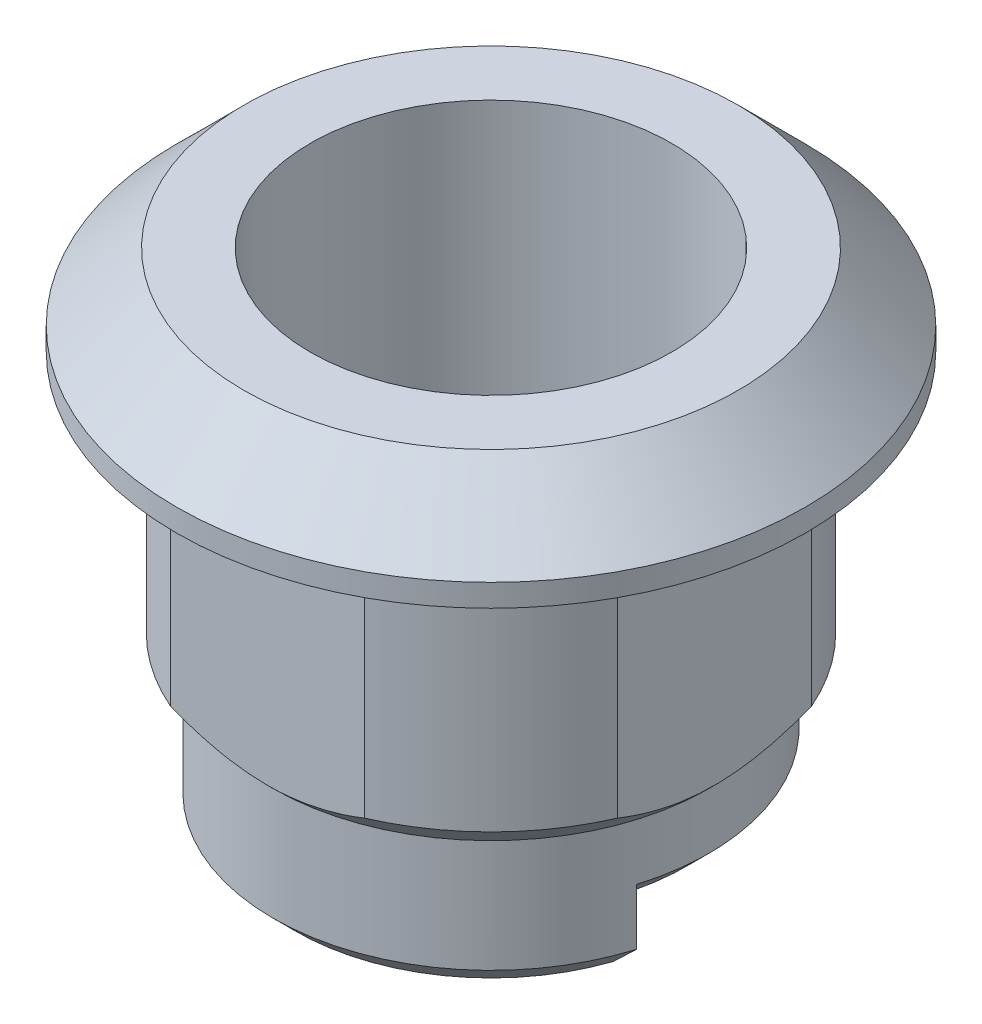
ISO-10303-21;
HEADER;
FILE_DESCRIPTION(('STEP AP214'),'2;1');
FILE_NAME('part.step','',(''),(''),'','','');
FILE_SCHEMA(('AUTOMOTIVE_DESIGN { 1 0 10303 214 1 1 1 1 }'));
ENDSEC;
DATA;
#1=APPLICATION_CONTEXT('core data for automotive mechanical design processes');
#2=APPLICATION_PROTOCOL_DEFINITION('international standard','automotive_design',2000,#1);
#3=PRODUCT_CONTEXT('',#1,'mechanical');
#4=PRODUCT('Part','Part','',(#3));
#5=PRODUCT_RELATED_PRODUCT_CATEGORY('part','',(#4));
#6=PRODUCT_DEFINITION_FORMATION('','',#4);
#7=PRODUCT_DEFINITION_CONTEXT('part definition',#1,'design');
#8=PRODUCT_DEFINITION('design','',#6,#7);
#9=PRODUCT_DEFINITION_SHAPE('','',#8);
#10=(LENGTH_UNIT() NAMED_UNIT(*) SI_UNIT(.MILLI.,.METRE.));
#11=(NAMED_UNIT(*) PLANE_ANGLE_UNIT() SI_UNIT($,.RADIAN.));
#12=(NAMED_UNIT(*) SI_UNIT($,.STERADIAN.) SOLID_ANGLE_UNIT());
#13=UNCERTAINTY_MEASURE_WITH_UNIT(LENGTH_MEASURE(1.E-05),#10,'distance_accuracy_value','');
#14=(GEOMETRIC_REPRESENTATION_CONTEXT(3) GLOBAL_UNCERTAINTY_ASSIGNED_CONTEXT((#13)) GLOBAL_UNIT_ASSIGNED_CONTEXT((#10,
#11,#12)) REPRESENTATION_CONTEXT('',''));
#15=CARTESIAN_POINT('',(0.,0.,0.));
#16=DIRECTION('',(0.,0.,1.));
#17=DIRECTION('',(1.,0.,0.));
#18=AXIS2_PLACEMENT_3D('',#15,#16,#17);
#19=CARTESIAN_POINT('',(0.,5.91279690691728,0.));
#20=DIRECTION('',(0.,1.,0.));
#21=DIRECTION('',(0.,0.,1.));
#22=AXIS2_PLACEMENT_3D('',#19,#20,#21);
#23=CYLINDRICAL_SURFACE('',#22,10.85);
#24=DIRECTION('',(0.,1.,0.));
#25=VECTOR('',#24,1.);
#26=CARTESIAN_POINT('',(-9.95,44.1244157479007,-4.32666153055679));
#27=LINE('',#26,#25);
#28=CARTESIAN_POINT('',(-9.95,0.,-4.32666153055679));
#29=VERTEX_POINT('',#28);
#30=CARTESIAN_POINT('',(-9.95,-10.85,-4.32666153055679));
#31=VERTEX_POINT('',#30);
#32=EDGE_CURVE('E119',#29,#31,#27,.F.);
#33=ORIENTED_EDGE('',*,*,#32,.F.);
#34=CARTESIAN_POINT('',(0.,0.,0.));
#35=DIRECTION('',(0.,1.,0.));
#36=DIRECTION('',(0.,0.,1.));
#37=AXIS2_PLACEMENT_3D('',#34,#35,#36);
#38=CIRCLE('',#37,10.85);
#39=CARTESIAN_POINT('',(-4.32666153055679,0.,-9.95));
#40=VERTEX_POINT('',#39);
#41=EDGE_CURVE('E297',#29,#40,#38,.F.);
#42=ORIENTED_EDGE('',*,*,#41,.T.);
#43=DIRECTION('',(0.,1.,0.));
#44=VECTOR('',#43,1.);
#45=CARTESIAN_POINT('',(-4.32666153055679,44.1244157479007,-9.95));
#46=LINE('',#45,#44);
#47=CARTESIAN_POINT('',(-4.32666153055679,-10.85,-9.95));
#48=VERTEX_POINT('',#47);
#49=EDGE_CURVE('E140',#48,#40,#46,.T.);
#50=ORIENTED_EDGE('',*,*,#49,.F.);
#51=CARTESIAN_POINT('',(0.,-10.85,0.));
#52=DIRECTION('',(0.,1.,0.));
#53=DIRECTION('',(0.,0.,1.));
#54=AXIS2_PLACEMENT_3D('',#51,#52,#53);
#55=CIRCLE('',#54,10.85);
#56=EDGE_CURVE('E134',#31,#48,#55,.F.);
#57=ORIENTED_EDGE('',*,*,#56,.F.);
#58=EDGE_LOOP('',(#33,#42,#50,#57));
#59=FACE_BOUND('',#58,.T.);
#60=ADVANCED_FACE('F16',(#59),#23,.T.);
#61=CARTESIAN_POINT('',(-9.95,44.1244157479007,-9.95));
#62=DIRECTION('',(0.,0.,-1.));
#63=DIRECTION('',(-1.,0.,0.));
#64=AXIS2_PLACEMENT_3D('',#61,#62,#63);
#65=PLANE('',#64);
#66=DIRECTION('',(0.,1.,0.));
#67=VECTOR('',#66,1.);
#68=CARTESIAN_POINT('',(4.32666153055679,5.91279690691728,-9.95));
#69=LINE('',#68,#67);
#70=CARTESIAN_POINT('',(4.32666153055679,-10.85,-9.95));
#71=VERTEX_POINT('',#70);
#72=CARTESIAN_POINT('',(4.32666153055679,0.,-9.95));
#73=VERTEX_POINT('',#72);
#74=EDGE_CURVE('E308',#71,#73,#69,.T.);
#75=ORIENTED_EDGE('',*,*,#74,.F.);
#76=CARTESIAN_POINT('',(-4.32666153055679,-10.85,-9.95));
#77=CARTESIAN_POINT('',(-4.15399995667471,-10.9188427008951,-9.95));
#78=CARTESIAN_POINT('',(-3.98016657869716,-10.9847033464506,-9.95));
#79=CARTESIAN_POINT('',(-3.63004510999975,-11.1097733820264,-9.95));
#80=CARTESIAN_POINT('',(-3.45375601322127,-11.1689799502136,-9.95));
#81=CARTESIAN_POINT('',(-2.92031040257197,-11.3357995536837,-9.95));
#82=CARTESIAN_POINT('',(-2.55949801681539,-11.4322367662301,-9.95));
#83=CARTESIAN_POINT('',(-2.0145703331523,-11.5496360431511,-9.95));
#84=CARTESIAN_POINT('',(-1.83329033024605,-11.5841131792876,-9.95));
#85=CARTESIAN_POINT('',(-1.46920939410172,-11.6437152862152,-9.95));
#86=CARTESIAN_POINT('',(-1.28640873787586,-11.6688419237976,-9.95));
#87=CARTESIAN_POINT('',(-0.919947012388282,-11.7092199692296,-9.95));
#88=CARTESIAN_POINT('',(-0.736287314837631,-11.7244837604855,-9.95));
#89=CARTESIAN_POINT('',(-0.368426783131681,-11.7448766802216,-9.95));
#90=CARTESIAN_POINT('',(-0.184225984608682,-11.7500064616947,-9.95));
#91=CARTESIAN_POINT('',(0.302858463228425,-11.7499893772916,-9.95));
#92=CARTESIAN_POINT('',(0.605784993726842,-11.73609767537,-9.95));
#93=CARTESIAN_POINT('',(1.2092236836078,-11.6813034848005,-9.95));
#94=CARTESIAN_POINT('',(1.50973490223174,-11.6403909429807,-9.95));
#95=CARTESIAN_POINT('',(2.10613484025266,-11.5337712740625,-9.95));
#96=CARTESIAN_POINT('',(2.40202540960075,-11.4680743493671,-9.95));
#97=CARTESIAN_POINT('',(2.98796571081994,-11.3148937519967,-9.95));
#98=CARTESIAN_POINT('',(3.27801714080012,-11.2274165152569,-9.95));
#99=CARTESIAN_POINT('',(3.69322141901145,-11.087376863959,-9.95));
#100=CARTESIAN_POINT('',(3.8209365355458,-11.0422286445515,-9.95));
#101=CARTESIAN_POINT('',(4.0748616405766,-10.9485763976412,-9.95));
#102=CARTESIAN_POINT('',(4.20107398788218,-10.9000787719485,-9.95));
#103=CARTESIAN_POINT('',(4.3266615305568,-10.85,-9.95));
#104=B_SPLINE_CURVE_WITH_KNOTS('',3,(#76,#77,#78,#79,#80,#81,#82,#83,#84,#85,#86,#87,#88,#89,
#90,#91,#92,#93,#94,#95,#96,#97,#98,#99,#100,#101,#102,#103),.UNSPECIFIED.,.F.,.F.,(4,2,2,2,2,2,
2,2,2,2,2,2,2,4),(0.,0.557565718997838,1.1153670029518,2.23394979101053,2.78734367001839,
3.34063885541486,3.89323798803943,4.44580151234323,5.3541887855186,6.26291421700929,
7.17126598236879,8.07934965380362,8.485692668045,8.89127944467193),.UNSPECIFIED.);
#105=EDGE_CURVE('E141',#48,#71,#104,.T.);
#106=ORIENTED_EDGE('',*,*,#105,.F.);
#107=ORIENTED_EDGE('',*,*,#49,.T.);
#108=DIRECTION('',(1.,0.,0.));
#109=VECTOR('',#108,1.);
#110=CARTESIAN_POINT('',(10.85,0.,-9.95));
#111=LINE('',#110,#109);
#112=EDGE_CURVE('E294',#40,#73,#111,.T.);
#113=ORIENTED_EDGE('',*,*,#112,.T.);
#114=EDGE_LOOP('',(#75,#106,#107,#113));
#115=FACE_BOUND('',#114,.T.);
#116=ADVANCED_FACE('F341',(#115),#65,.T.);
#117=CARTESIAN_POINT('',(0.,5.91279690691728,0.));
#118=DIRECTION('',(0.,1.,0.));
#119=DIRECTION('',(0.,0.,1.));
#120=AXIS2_PLACEMENT_3D('',#117,#118,#119);
#121=CYLINDRICAL_SURFACE('',#120,10.85);
#122=DIRECTION('',(0.,1.,0.));
#123=VECTOR('',#122,1.);
#124=CARTESIAN_POINT('',(9.95,44.1244157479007,-4.32666153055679));
#125=LINE('',#124,#123);
#126=CARTESIAN_POINT('',(9.95,-10.85,-4.32666153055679));
#127=VERTEX_POINT('',#126);
#128=CARTESIAN_POINT('',(9.95,0.,-4.32666153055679));
#129=VERTEX_POINT('',#128);
#130=EDGE_CURVE('E306',#127,#129,#125,.T.);
#131=ORIENTED_EDGE('',*,*,#130,.F.);
#132=CARTESIAN_POINT('',(0.,-10.85,0.));
#133=DIRECTION('',(0.,1.,0.));
#134=DIRECTION('',(0.,0.,1.));
#135=AXIS2_PLACEMENT_3D('',#132,#133,#134);
#136=CIRCLE('',#135,10.85);
#137=EDGE_CURVE('E143',#71,#127,#136,.F.);
#138=ORIENTED_EDGE('',*,*,#137,.F.);
#139=ORIENTED_EDGE('',*,*,#74,.T.);
#140=CARTESIAN_POINT('',(0.,0.,0.));
#141=DIRECTION('',(0.,1.,0.));
#142=DIRECTION('',(0.,0.,1.));
#143=AXIS2_PLACEMENT_3D('',#140,#141,#142);
#144=CIRCLE('',#143,10.85);
#145=EDGE_CURVE('E293',#73,#129,#144,.F.);
#146=ORIENTED_EDGE('',*,*,#145,.T.);
#147=EDGE_LOOP('',(#131,#138,#139,#146));
#148=FACE_BOUND('',#147,.T.);
#149=ADVANCED_FACE('F338',(#148),#121,.T.);
#150=CARTESIAN_POINT('',(9.95,44.1244157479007,9.95));
#151=DIRECTION('',(1.,0.,0.));
#152=DIRECTION('',(0.,0.,-1.));
#153=AXIS2_PLACEMENT_3D('',#150,#151,#152);
#154=PLANE('',#153);
#155=ORIENTED_EDGE('',*,*,#130,.T.);
#156=DIRECTION('',(0.,0.,1.));
#157=VECTOR('',#156,1.);
#158=CARTESIAN_POINT('',(9.95,0.,0.));
#159=LINE('',#158,#157);
#160=CARTESIAN_POINT('',(9.95,0.,4.32666153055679));
#161=VERTEX_POINT('',#160);
#162=EDGE_CURVE('E290',#129,#161,#159,.T.);
#163=ORIENTED_EDGE('',*,*,#162,.T.);
#164=DIRECTION('',(0.,1.,0.));
#165=VECTOR('',#164,1.);
#166=CARTESIAN_POINT('',(9.95,5.91279690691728,4.32666153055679));
#167=LINE('',#166,#165);
#168=CARTESIAN_POINT('',(9.95,-10.85,4.32666153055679));
#169=VERTEX_POINT('',#168);
#170=EDGE_CURVE('E304',#169,#161,#167,.T.);
#171=ORIENTED_EDGE('',*,*,#170,.F.);
#172=CARTESIAN_POINT('',(9.95,-10.85,-4.32666153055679));
#173=CARTESIAN_POINT('',(9.95,-10.9804773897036,-3.99957981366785));
#174=CARTESIAN_POINT('',(9.95,-11.1002947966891,-3.66783324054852));
#175=CARTESIAN_POINT('',(9.95,-11.313875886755,-2.99512640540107));
#176=CARTESIAN_POINT('',(9.95,-11.4075680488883,-2.6541436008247));
#177=CARTESIAN_POINT('',(9.95,-11.5627152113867,-1.96790539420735));
#178=CARTESIAN_POINT('',(9.95,-11.62444730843,-1.62271422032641));
#179=CARTESIAN_POINT('',(9.95,-11.71272497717,-0.928179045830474));
#180=CARTESIAN_POINT('',(9.95,-11.7393111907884,-0.578840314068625));
#181=CARTESIAN_POINT('',(9.95,-11.7550761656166,0.105946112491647));
#182=CARTESIAN_POINT('',(9.95,-11.7457845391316,0.441358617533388));
#183=CARTESIAN_POINT('',(9.95,-11.6938595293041,1.10970843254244));
#184=CARTESIAN_POINT('',(9.95,-11.6512101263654,1.44264447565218));
#185=CARTESIAN_POINT('',(9.95,-11.5354396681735,2.10270830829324));
#186=CARTESIAN_POINT('',(9.95,-11.4623502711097,2.4298417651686));
#187=CARTESIAN_POINT('',(9.95,-11.2897501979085,3.0770407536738));
#188=CARTESIAN_POINT('',(9.95,-11.1902356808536,3.39710525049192));
#189=CARTESIAN_POINT('',(9.95,-11.0436491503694,3.81636788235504));
#190=CARTESIAN_POINT('',(9.95,-11.0064076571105,3.91911038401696));
#191=CARTESIAN_POINT('',(9.95,-10.9297853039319,4.1235889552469));
#192=CARTESIAN_POINT('',(9.95,-10.8904083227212,4.22532647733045));
#193=CARTESIAN_POINT('',(9.95,-10.85,4.3266615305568));
#194=B_SPLINE_CURVE_WITH_KNOTS('',3,(#172,#173,#174,#175,#176,#177,#178,#179,#180,#181,#182,
#183,#184,#185,#186,#187,#188,#189,#190,#191,#192,#193),.UNSPECIFIED.,.F.,.F.,(4,2,2,2,2,2,2,2,
2,2,4),(0.,1.05682884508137,2.1165230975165,3.16686899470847,4.21599922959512,5.22090498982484,
6.22629363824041,7.2306392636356,8.23513095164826,8.56296779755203,8.89022793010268),.UNSPECIFIED.);
#195=EDGE_CURVE('E312',#127,#169,#194,.T.);
#196=ORIENTED_EDGE('',*,*,#195,.F.);
#197=EDGE_LOOP('',(#155,#163,#171,#196));
#198=FACE_BOUND('',#197,.T.);
#199=ADVANCED_FACE('F332',(#198),#154,.T.);
#200=CARTESIAN_POINT('',(0.,5.91279690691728,0.));
#201=DIRECTION('',(0.,1.,0.));
#202=DIRECTION('',(0.,0.,1.));
#203=AXIS2_PLACEMENT_3D('',#200,#201,#202);
#204=CYLINDRICAL_SURFACE('',#203,10.85);
#205=DIRECTION('',(0.,1.,0.));
#206=VECTOR('',#205,1.);
#207=CARTESIAN_POINT('',(4.3266615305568,44.1244157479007,9.95));
#208=LINE('',#207,#206);
#209=CARTESIAN_POINT('',(4.32666153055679,-10.85,9.95));
#210=VERTEX_POINT('',#209);
#211=CARTESIAN_POINT('',(4.3266615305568,0.,9.95));
#212=VERTEX_POINT('',#211);
#213=EDGE_CURVE('E302',#210,#212,#208,.T.);
#214=ORIENTED_EDGE('',*,*,#213,.F.);
#215=CARTESIAN_POINT('',(0.,-10.85,0.));
#216=DIRECTION('',(0.,1.,0.));
#217=DIRECTION('',(0.,0.,1.));
#218=AXIS2_PLACEMENT_3D('',#215,#216,#217);
#219=CIRCLE('',#218,10.85);
#220=EDGE_CURVE('E310',#169,#210,#219,.F.);
#221=ORIENTED_EDGE('',*,*,#220,.F.);
#222=ORIENTED_EDGE('',*,*,#170,.T.);
#223=CARTESIAN_POINT('',(0.,0.,0.));
#224=DIRECTION('',(0.,1.,0.));
#225=DIRECTION('',(0.,0.,1.));
#226=AXIS2_PLACEMENT_3D('',#223,#224,#225);
#227=CIRCLE('',#226,10.85);
#228=EDGE_CURVE('E289',#161,#212,#227,.F.);
#229=ORIENTED_EDGE('',*,*,#228,.T.);
#230=EDGE_LOOP('',(#214,#221,#222,#229));
#231=FACE_BOUND('',#230,.T.);
#232=ADVANCED_FACE('F337',(#231),#204,.T.);
#233=CARTESIAN_POINT('',(-9.95,44.1244157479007,9.94999999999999));
#234=DIRECTION('',(0.,0.,1.));
#235=DIRECTION('',(1.,0.,0.));
#236=AXIS2_PLACEMENT_3D('',#233,#234,#235);
#237=PLANE('',#236);
#238=ORIENTED_EDGE('',*,*,#213,.T.);
#239=DIRECTION('',(1.,0.,0.));
#240=VECTOR('',#239,1.);
#241=CARTESIAN_POINT('',(10.85,0.,9.95));
#242=LINE('',#241,#240);
#243=CARTESIAN_POINT('',(-4.3266615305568,0.,9.95));
#244=VERTEX_POINT('',#243);
#245=EDGE_CURVE('E286',#212,#244,#242,.F.);
#246=ORIENTED_EDGE('',*,*,#245,.T.);
#247=DIRECTION('',(0.,1.,0.));
#248=VECTOR('',#247,1.);
#249=CARTESIAN_POINT('',(-4.3266615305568,5.91279690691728,9.95));
#250=LINE('',#249,#248);
#251=CARTESIAN_POINT('',(-4.3266615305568,-10.85,9.95));
#252=VERTEX_POINT('',#251);
#253=EDGE_CURVE('E128',#252,#244,#250,.T.);
#254=ORIENTED_EDGE('',*,*,#253,.F.);
#255=CARTESIAN_POINT('',(4.3266615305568,-10.85,9.95));
#256=CARTESIAN_POINT('',(4.15399995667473,-10.9188427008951,9.95));
#257=CARTESIAN_POINT('',(3.98016657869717,-10.9847033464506,9.95));
#258=CARTESIAN_POINT('',(3.63004510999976,-11.1097733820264,9.95));
#259=CARTESIAN_POINT('',(3.45375601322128,-11.1689799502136,9.95));
#260=CARTESIAN_POINT('',(2.92031040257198,-11.3357995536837,9.95));
#261=CARTESIAN_POINT('',(2.5594980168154,-11.4322367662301,9.95));
#262=CARTESIAN_POINT('',(2.0145703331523,-11.5496360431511,9.95));
#263=CARTESIAN_POINT('',(1.83329033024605,-11.5841131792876,9.95));
#264=CARTESIAN_POINT('',(1.46920939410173,-11.6437152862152,9.95));
#265=CARTESIAN_POINT('',(1.28640873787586,-11.6688419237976,9.95));
#266=CARTESIAN_POINT('',(0.919947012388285,-11.7092199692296,9.95));
#267=CARTESIAN_POINT('',(0.736287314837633,-11.7244837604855,9.95));
#268=CARTESIAN_POINT('',(0.368426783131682,-11.7448766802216,9.95));
#269=CARTESIAN_POINT('',(0.184225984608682,-11.7500064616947,9.95));
#270=CARTESIAN_POINT('',(-0.302858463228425,-11.7499893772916,9.95));
#271=CARTESIAN_POINT('',(-0.605784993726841,-11.73609767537,9.95));
#272=CARTESIAN_POINT('',(-1.2092236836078,-11.6813034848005,9.95));
#273=CARTESIAN_POINT('',(-1.50973490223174,-11.6403909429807,9.95));
#274=CARTESIAN_POINT('',(-2.10613484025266,-11.5337712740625,9.95));
#275=CARTESIAN_POINT('',(-2.40202540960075,-11.4680743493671,9.95));
#276=CARTESIAN_POINT('',(-2.98796571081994,-11.3148937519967,9.95));
#277=CARTESIAN_POINT('',(-3.27801714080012,-11.2274165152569,9.95));
#278=CARTESIAN_POINT('',(-3.69322141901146,-11.0873768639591,9.95));
#279=CARTESIAN_POINT('',(-3.8209365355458,-11.0422286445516,9.95));
#280=CARTESIAN_POINT('',(-4.0748616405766,-10.9485763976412,9.95));
#281=CARTESIAN_POINT('',(-4.20107398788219,-10.9000787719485,9.95));
#282=CARTESIAN_POINT('',(-4.3266615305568,-10.85,9.95));
#283=B_SPLINE_CURVE_WITH_KNOTS('',3,(#255,#256,#257,#258,#259,#260,#261,#262,#263,#264,#265,
#266,#267,#268,#269,#270,#271,#272,#273,#274,#275,#276,#277,#278,#279,#280,#281,#282),
.UNSPECIFIED.,.F.,.F.,(4,2,2,2,2,2,2,2,2,2,2,2,2,4),(0.,0.557565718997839,1.1153670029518,
2.23394979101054,2.7873436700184,3.34063885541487,3.89323798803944,4.44580151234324,
5.35418878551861,6.2629142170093,7.1712659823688,8.07934965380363,8.48569266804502,
8.89127944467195),.UNSPECIFIED.);
#284=EDGE_CURVE('E311',#210,#252,#283,.T.);
#285=ORIENTED_EDGE('',*,*,#284,.F.);
#286=EDGE_LOOP('',(#238,#246,#254,#285));
#287=FACE_BOUND('',#286,.T.);
#288=ADVANCED_FACE('F363',(#287),#237,.T.);
#289=CARTESIAN_POINT('',(0.,5.91279690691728,0.));
#290=DIRECTION('',(0.,1.,0.));
#291=DIRECTION('',(0.,0.,1.));
#292=AXIS2_PLACEMENT_3D('',#289,#290,#291);
#293=CYLINDRICAL_SURFACE('',#292,10.85);
#294=DIRECTION('',(0.,1.,0.));
#295=VECTOR('',#294,1.);
#296=CARTESIAN_POINT('',(-9.95,44.1244157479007,4.3266615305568));
#297=LINE('',#296,#295);
#298=CARTESIAN_POINT('',(-9.95,-10.85,4.32666153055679));
#299=VERTEX_POINT('',#298);
#300=CARTESIAN_POINT('',(-9.95,0.,4.3266615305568));
#301=VERTEX_POINT('',#300);
#302=EDGE_CURVE('E127',#299,#301,#297,.T.);
#303=ORIENTED_EDGE('',*,*,#302,.F.);
#304=CARTESIAN_POINT('',(0.,-10.85,0.));
#305=DIRECTION('',(0.,1.,0.));
#306=DIRECTION('',(0.,0.,1.));
#307=AXIS2_PLACEMENT_3D('',#304,#305,#306);
#308=CIRCLE('',#307,10.85);
#309=EDGE_CURVE('E138',#252,#299,#308,.F.);
#310=ORIENTED_EDGE('',*,*,#309,.F.);
#311=ORIENTED_EDGE('',*,*,#253,.T.);
#312=CARTESIAN_POINT('',(0.,0.,0.));
#313=DIRECTION('',(0.,1.,0.));
#314=DIRECTION('',(0.,0.,1.));
#315=AXIS2_PLACEMENT_3D('',#312,#313,#314);
#316=CIRCLE('',#315,10.85);
#317=EDGE_CURVE('E203',#244,#301,#316,.F.);
#318=ORIENTED_EDGE('',*,*,#317,.T.);
#319=EDGE_LOOP('',(#303,#310,#311,#318));
#320=FACE_BOUND('',#319,.T.);
#321=ADVANCED_FACE('F367',(#320),#293,.T.);
#322=CARTESIAN_POINT('',(-9.95,44.1244157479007,9.94999999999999));
#323=DIRECTION('',(-1.,0.,0.));
#324=DIRECTION('',(0.,0.,1.));
#325=AXIS2_PLACEMENT_3D('',#322,#323,#324);
#326=PLANE('',#325);
#327=ORIENTED_EDGE('',*,*,#302,.T.);
#328=DIRECTION('',(0.,0.,1.));
#329=VECTOR('',#328,1.);
#330=CARTESIAN_POINT('',(-9.95,0.,0.));
#331=LINE('',#330,#329);
#332=EDGE_CURVE('E123',#301,#29,#331,.F.);
#333=ORIENTED_EDGE('',*,*,#332,.T.);
#334=ORIENTED_EDGE('',*,*,#32,.T.);
#335=CARTESIAN_POINT('',(-9.95,-10.85,4.3266615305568));
#336=CARTESIAN_POINT('',(-9.95,-10.9804773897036,3.99957981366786));
#337=CARTESIAN_POINT('',(-9.95,-11.1002947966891,3.66783324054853));
#338=CARTESIAN_POINT('',(-9.95,-11.3138758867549,2.99512640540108));
#339=CARTESIAN_POINT('',(-9.95,-11.4075680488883,2.65414360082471));
#340=CARTESIAN_POINT('',(-9.95,-11.5627152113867,1.96790539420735));
#341=CARTESIAN_POINT('',(-9.95,-11.62444730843,1.62271422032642));
#342=CARTESIAN_POINT('',(-9.95,-11.71272497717,0.928179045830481));
#343=CARTESIAN_POINT('',(-9.95,-11.7393111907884,0.578840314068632));
#344=CARTESIAN_POINT('',(-9.95,-11.7550761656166,-0.10594611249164));
#345=CARTESIAN_POINT('',(-9.95,-11.7457845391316,-0.441358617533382));
#346=CARTESIAN_POINT('',(-9.95,-11.6938595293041,-1.10970843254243));
#347=CARTESIAN_POINT('',(-9.95,-11.6512101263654,-1.44264447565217));
#348=CARTESIAN_POINT('',(-9.95,-11.5354396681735,-2.10270830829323));
#349=CARTESIAN_POINT('',(-9.95,-11.4623502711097,-2.42984176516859));
#350=CARTESIAN_POINT('',(-9.95,-11.2897501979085,-3.0770407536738));
#351=CARTESIAN_POINT('',(-9.95,-11.1902356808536,-3.39710525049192));
#352=CARTESIAN_POINT('',(-9.95,-11.0436491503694,-3.81636788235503));
#353=CARTESIAN_POINT('',(-9.95,-11.0064076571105,-3.91911038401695));
#354=CARTESIAN_POINT('',(-9.95,-10.9297853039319,-4.12358895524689));
#355=CARTESIAN_POINT('',(-9.95,-10.8904083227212,-4.22532647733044));
#356=CARTESIAN_POINT('',(-9.95,-10.85,-4.32666153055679));
#357=B_SPLINE_CURVE_WITH_KNOTS('',3,(#335,#336,#337,#338,#339,#340,#341,#342,#343,#344,#345,
#346,#347,#348,#349,#350,#351,#352,#353,#354,#355,#356),.UNSPECIFIED.,.F.,.F.,(4,2,2,2,2,2,2,2,
2,2,4),(0.,1.05682884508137,2.1165230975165,3.16686899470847,4.21599922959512,5.22090498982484,
6.22629363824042,7.23063926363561,8.23513095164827,8.56296779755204,8.89022793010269),.UNSPECIFIED.);
#358=EDGE_CURVE('E19',#299,#31,#357,.T.);
#359=ORIENTED_EDGE('',*,*,#358,.F.);
#360=EDGE_LOOP('',(#327,#333,#334,#359));
#361=FACE_BOUND('',#360,.T.);
#362=ADVANCED_FACE('F121',(#361),#326,.T.);
#363=CARTESIAN_POINT('',(0.,-10.85,0.));
#364=DIRECTION('',(0.,1.,0.));
#365=DIRECTION('',(0.,0.,1.));
#366=AXIS2_PLACEMENT_3D('',#363,#364,#365);
#367=CONICAL_SURFACE('',#366,10.85,0.785398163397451);
#368=ORIENTED_EDGE('',*,*,#56,.T.);
#369=ORIENTED_EDGE('',*,*,#105,.T.);
#370=ORIENTED_EDGE('',*,*,#137,.T.);
#371=ORIENTED_EDGE('',*,*,#195,.T.);
#372=ORIENTED_EDGE('',*,*,#220,.T.);
#373=ORIENTED_EDGE('',*,*,#284,.T.);
#374=ORIENTED_EDGE('',*,*,#309,.T.);
#375=ORIENTED_EDGE('',*,*,#358,.T.);
#376=EDGE_LOOP('',(#368,#369,#370,#371,#372,#373,#374,#375));
#377=FACE_BOUND('',#376,.T.);
#378=CARTESIAN_POINT('',(0.,-12.,0.));
#379=DIRECTION('',(0.,1.,0.));
#380=DIRECTION('',(0.,0.,1.));
#381=AXIS2_PLACEMENT_3D('',#378,#379,#380);
#382=CIRCLE('',#381,9.7);
#383=CARTESIAN_POINT('',(0.,-12.,9.7));
#384=VERTEX_POINT('',#383);
#385=EDGE_CURVE('E200',#384,#384,#382,.F.);
#386=ORIENTED_EDGE('',*,*,#385,.F.);
#387=EDGE_LOOP('',(#386));
#388=FACE_BOUND('',#387,.T.);
#389=ADVANCED_FACE('F132',(#377,#388),#367,.T.);
#390=CARTESIAN_POINT('',(10.85,0.,0.));
#391=DIRECTION('',(0.,1.,0.));
#392=DIRECTION('',(0.,0.,1.));
#393=AXIS2_PLACEMENT_3D('',#390,#391,#392);
#394=PLANE('',#393);
#395=ORIENTED_EDGE('',*,*,#317,.F.);
#396=ORIENTED_EDGE('',*,*,#245,.F.);
#397=ORIENTED_EDGE('',*,*,#228,.F.);
#398=ORIENTED_EDGE('',*,*,#162,.F.);
#399=ORIENTED_EDGE('',*,*,#145,.F.);
#400=ORIENTED_EDGE('',*,*,#112,.F.);
#401=ORIENTED_EDGE('',*,*,#41,.F.);
#402=ORIENTED_EDGE('',*,*,#332,.F.);
#403=EDGE_LOOP('',(#395,#396,#397,#398,#399,#400,#401,#402));
#404=FACE_BOUND('',#403,.T.);
#405=CARTESIAN_POINT('',(0.,0.,0.));
#406=DIRECTION('',(0.,1.,0.));
#407=DIRECTION('',(0.,0.,1.));
#408=AXIS2_PLACEMENT_3D('',#405,#406,#407);
#409=CIRCLE('',#408,14.);
#410=CARTESIAN_POINT('',(0.,0.,14.));
#411=VERTEX_POINT('',#410);
#412=EDGE_CURVE('E201',#411,#411,#409,.T.);
#413=ORIENTED_EDGE('',*,*,#412,.F.);
#414=EDGE_LOOP('',(#413));
#415=FACE_BOUND('',#414,.T.);
#416=ADVANCED_FACE('F210',(#404,#415),#394,.F.);
#417=CARTESIAN_POINT('',(0.,-17.,0.));
#418=DIRECTION('',(0.,1.,0.));
#419=DIRECTION('',(-1.,0.,0.));
#420=AXIS2_PLACEMENT_3D('',#417,#418,#419);
#421=CONICAL_SURFACE('',#420,9.7,0.785398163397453);
#422=CARTESIAN_POINT('',(8.23711114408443,-18.,2.8));
#423=CARTESIAN_POINT('',(8.32485454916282,-17.916924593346,2.8));
#424=CARTESIAN_POINT('',(8.41252973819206,-17.8337771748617,2.8));
#425=CARTESIAN_POINT('',(8.58775407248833,-17.667349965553,2.8));
#426=CARTESIAN_POINT('',(8.67530321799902,-17.5840701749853,2.8));
#427=CARTESIAN_POINT('',(8.85028616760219,-17.4173895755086,2.8));
#428=CARTESIAN_POINT('',(8.93771997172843,-17.3339887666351,2.8));
#429=CARTESIAN_POINT('',(9.11248136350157,-17.1670755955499,2.8));
#430=CARTESIAN_POINT('',(9.19980895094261,-17.0835632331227,2.8));
#431=CARTESIAN_POINT('',(9.28708781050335,-17.,2.8));
#432=B_SPLINE_CURVE_WITH_KNOTS('',3,(#422,#423,#424,#425,#426,#427,#428,#429,#430,#431),
.UNSPECIFIED.,.F.,.F.,(4,2,2,2,4),(0.,0.362496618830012,0.724992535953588,1.08748834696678,
1.44998485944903),.UNSPECIFIED.);
#433=CARTESIAN_POINT('',(8.23711114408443,-18.,2.8));
#434=VERTEX_POINT('',#433);
#435=CARTESIAN_POINT('',(9.28708781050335,-17.,2.8));
#436=VERTEX_POINT('',#435);
#437=EDGE_CURVE('E193',#434,#436,#432,.T.);
#438=ORIENTED_EDGE('',*,*,#437,.T.);
#439=CARTESIAN_POINT('',(0.,-17.,0.));
#440=DIRECTION('',(0.,1.,0.));
#441=DIRECTION('',(0.,0.,1.));
#442=AXIS2_PLACEMENT_3D('',#439,#440,#441);
#443=CIRCLE('',#442,9.7);
#444=CARTESIAN_POINT('',(-2.8,-17.,-9.28708781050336));
#445=VERTEX_POINT('',#444);
#446=EDGE_CURVE('E278',#445,#436,#443,.T.);
#447=ORIENTED_EDGE('',*,*,#446,.F.);
#448=CARTESIAN_POINT('',(-2.8,-17.,-9.28708781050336));
#449=CARTESIAN_POINT('',(-2.8,-17.0835632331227,-9.19980895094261));
#450=CARTESIAN_POINT('',(-2.8,-17.1670755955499,-9.11248136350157));
#451=CARTESIAN_POINT('',(-2.8,-17.3339887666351,-8.93771997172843));
#452=CARTESIAN_POINT('',(-2.8,-17.4173895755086,-8.85028616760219));
#453=CARTESIAN_POINT('',(-2.8,-17.5840701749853,-8.67530321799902));
#454=CARTESIAN_POINT('',(-2.8,-17.667349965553,-8.58775407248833));
#455=CARTESIAN_POINT('',(-2.8,-17.8337771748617,-8.41252973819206));
#456=CARTESIAN_POINT('',(-2.8,-17.916924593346,-8.32485454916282));
#457=CARTESIAN_POINT('',(-2.8,-18.,-8.23711114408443));
#458=B_SPLINE_CURVE_WITH_KNOTS('',3,(#448,#449,#450,#451,#452,#453,#454,#455,#456,#457),
.UNSPECIFIED.,.F.,.F.,(4,2,2,2,4),(0.,0.362496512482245,0.72499232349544,1.08748824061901,
1.44998485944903),.UNSPECIFIED.);
#459=CARTESIAN_POINT('',(-2.8,-18.,-8.23711114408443));
#460=VERTEX_POINT('',#459);
#461=EDGE_CURVE('E214',#445,#460,#458,.T.);
#462=ORIENTED_EDGE('',*,*,#461,.T.);
#463=CARTESIAN_POINT('',(0.,-18.,0.));
#464=DIRECTION('',(0.,1.,0.));
#465=DIRECTION('',(-1.,0.,0.));
#466=AXIS2_PLACEMENT_3D('',#463,#464,#465);
#467=CIRCLE('',#466,8.69999999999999);
#468=EDGE_CURVE('E175',#460,#434,#467,.T.);
#469=ORIENTED_EDGE('',*,*,#468,.T.);
#470=EDGE_LOOP('',(#438,#447,#462,#469));
#471=FACE_BOUND('',#470,.T.);
#472=ADVANCED_FACE('F205',(#471),#421,.T.);
#473=CARTESIAN_POINT('',(0.,5.91279690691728,0.));
#474=DIRECTION('',(0.,1.,0.));
#475=DIRECTION('',(0.,0.,1.));
#476=AXIS2_PLACEMENT_3D('',#473,#474,#475);
#477=CYLINDRICAL_SURFACE('',#476,9.7);
#478=ORIENTED_EDGE('',*,*,#385,.T.);
#479=EDGE_LOOP('',(#478));
#480=FACE_BOUND('',#479,.T.);
#481=ORIENTED_EDGE('',*,*,#446,.T.);
#482=DIRECTION('',(0.,1.,0.));
#483=VECTOR('',#482,1.);
#484=CARTESIAN_POINT('',(9.28708781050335,-15.5,2.8));
#485=LINE('',#484,#483);
#486=CARTESIAN_POINT('',(9.28708781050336,-14.5,2.8));
#487=VERTEX_POINT('',#486);
#488=EDGE_CURVE('E174',#436,#487,#485,.T.);
#489=ORIENTED_EDGE('',*,*,#488,.T.);
#490=CARTESIAN_POINT('',(0.,-14.5,0.));
#491=DIRECTION('',(0.,1.,0.));
#492=DIRECTION('',(-1.,0.,0.));
#493=AXIS2_PLACEMENT_3D('',#490,#491,#492);
#494=CIRCLE('',#493,9.7);
#495=CARTESIAN_POINT('',(-2.8,-14.5,-9.28708781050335));
#496=VERTEX_POINT('',#495);
#497=EDGE_CURVE('E276',#496,#487,#494,.F.);
#498=ORIENTED_EDGE('',*,*,#497,.F.);
#499=DIRECTION('',(0.,1.,0.));
#500=VECTOR('',#499,1.);
#501=CARTESIAN_POINT('',(-2.8,-15.5,-9.28708781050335));
#502=LINE('',#501,#500);
#503=EDGE_CURVE('E220',#496,#445,#502,.F.);
#504=ORIENTED_EDGE('',*,*,#503,.T.);
#505=EDGE_LOOP('',(#481,#489,#498,#504));
#506=FACE_BOUND('',#505,.T.);
#507=ADVANCED_FACE('F209',(#480,#506),#477,.T.);
#508=CARTESIAN_POINT('',(0.,-14.5,0.));
#509=DIRECTION('',(0.,1.,0.));
#510=DIRECTION('',(0.,0.,1.));
#511=AXIS2_PLACEMENT_3D('',#508,#509,#510);
#512=CONICAL_SURFACE('',#511,9.7,0.785398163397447);
#513=CARTESIAN_POINT('',(-2.8,-15.5,-8.23711114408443));
#514=CARTESIAN_POINT('',(-2.8,-15.416924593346,-8.32485454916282));
#515=CARTESIAN_POINT('',(-2.8,-15.3337771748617,-8.41252973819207));
#516=CARTESIAN_POINT('',(-2.8,-15.167349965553,-8.58775407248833));
#517=CARTESIAN_POINT('',(-2.8,-15.0840701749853,-8.67530321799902));
#518=CARTESIAN_POINT('',(-2.8,-14.9173895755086,-8.85028616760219));
#519=CARTESIAN_POINT('',(-2.8,-14.8339887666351,-8.93771997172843));
#520=CARTESIAN_POINT('',(-2.8,-14.6670755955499,-9.11248136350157));
#521=CARTESIAN_POINT('',(-2.8,-14.5835632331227,-9.19980895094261));
#522=CARTESIAN_POINT('',(-2.8,-14.5,-9.28708781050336));
#523=B_SPLINE_CURVE_WITH_KNOTS('',3,(#513,#514,#515,#516,#517,#518,#519,#520,#521,#522),
.UNSPECIFIED.,.F.,.F.,(4,2,2,2,4),(0.,0.362496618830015,0.72499253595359,1.08748834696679,
1.44998485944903),.UNSPECIFIED.);
#524=CARTESIAN_POINT('',(-2.8,-15.5,-8.23711114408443));
#525=VERTEX_POINT('',#524);
#526=EDGE_CURVE('E219',#525,#496,#523,.T.);
#527=ORIENTED_EDGE('',*,*,#526,.T.);
#528=ORIENTED_EDGE('',*,*,#497,.T.);
#529=CARTESIAN_POINT('',(9.28708781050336,-14.5,2.8));
#530=CARTESIAN_POINT('',(9.19980895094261,-14.5835632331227,2.8));
#531=CARTESIAN_POINT('',(9.11248136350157,-14.6670755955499,2.8));
#532=CARTESIAN_POINT('',(8.93771997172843,-14.8339887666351,2.8));
#533=CARTESIAN_POINT('',(8.85028616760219,-14.9173895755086,2.8));
#534=CARTESIAN_POINT('',(8.67530321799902,-15.0840701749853,2.8));
#535=CARTESIAN_POINT('',(8.58775407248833,-15.167349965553,2.8));
#536=CARTESIAN_POINT('',(8.41252973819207,-15.3337771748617,2.8));
#537=CARTESIAN_POINT('',(8.32485454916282,-15.416924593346,2.8));
#538=CARTESIAN_POINT('',(8.23711114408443,-15.5,2.8));
#539=B_SPLINE_CURVE_WITH_KNOTS('',3,(#529,#530,#531,#532,#533,#534,#535,#536,#537,#538),
.UNSPECIFIED.,.F.,.F.,(4,2,2,2,4),(0.,0.362496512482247,0.724992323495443,1.08748824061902,
1.44998485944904),.UNSPECIFIED.);
#540=CARTESIAN_POINT('',(8.23711114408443,-15.5,2.8));
#541=VERTEX_POINT('',#540);
#542=EDGE_CURVE('E166',#487,#541,#539,.T.);
#543=ORIENTED_EDGE('',*,*,#542,.T.);
#544=CARTESIAN_POINT('',(0.,-15.5,0.));
#545=DIRECTION('',(0.,1.,0.));
#546=DIRECTION('',(0.,0.,1.));
#547=AXIS2_PLACEMENT_3D('',#544,#545,#546);
#548=CIRCLE('',#547,8.7);
#549=EDGE_CURVE('E163',#525,#541,#548,.F.);
#550=ORIENTED_EDGE('',*,*,#549,.F.);
#551=EDGE_LOOP('',(#527,#528,#543,#550));
#552=FACE_BOUND('',#551,.T.);
#553=ADVANCED_FACE('F177',(#552),#512,.T.);
#554=CARTESIAN_POINT('',(0.,5.91279690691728,0.));
#555=DIRECTION('',(0.,1.,0.));
#556=DIRECTION('',(0.,0.,1.));
#557=AXIS2_PLACEMENT_3D('',#554,#555,#556);
#558=CYLINDRICAL_SURFACE('',#557,14.);
#559=CARTESIAN_POINT('',(0.,1.,0.));
#560=DIRECTION('',(0.,-1.,0.));
#561=DIRECTION('',(0.,0.,-1.));
#562=AXIS2_PLACEMENT_3D('',#559,#560,#561);
#563=CIRCLE('',#562,14.);
#564=CARTESIAN_POINT('',(0.,1.,-14.));
#565=VERTEX_POINT('',#564);
#566=EDGE_CURVE('E267',#565,#565,#563,.F.);
#567=ORIENTED_EDGE('',*,*,#566,.F.);
#568=EDGE_LOOP('',(#567));
#569=FACE_BOUND('',#568,.T.);
#570=ORIENTED_EDGE('',*,*,#412,.T.);
#571=EDGE_LOOP('',(#570));
#572=FACE_BOUND('',#571,.T.);
#573=ADVANCED_FACE('F227',(#569,#572),#558,.T.);
#574=CARTESIAN_POINT('',(-2.8,-15.5,2.8));
#575=DIRECTION('',(-1.,0.,0.));
#576=DIRECTION('',(0.,0.,1.));
#577=AXIS2_PLACEMENT_3D('',#574,#575,#576);
#578=PLANE('',#577);
#579=DIRECTION('',(0.,0.,-1.));
#580=VECTOR('',#579,1.);
#581=CARTESIAN_POINT('',(-2.8,-15.5,0.));
#582=LINE('',#581,#580);
#583=CARTESIAN_POINT('',(-2.8,-15.5,-4.1424630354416));
#584=VERTEX_POINT('',#583);
#585=EDGE_CURVE('E165',#584,#525,#582,.T.);
#586=ORIENTED_EDGE('',*,*,#585,.F.);
#587=DIRECTION('',(0.,1.,0.));
#588=VECTOR('',#587,1.);
#589=CARTESIAN_POINT('',(-2.8,5.91279690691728,-4.1424630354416));
#590=LINE('',#589,#588);
#591=CARTESIAN_POINT('',(-2.8,-18.,-4.1424630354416));
#592=VERTEX_POINT('',#591);
#593=EDGE_CURVE('E162',#584,#592,#590,.F.);
#594=ORIENTED_EDGE('',*,*,#593,.T.);
#595=DIRECTION('',(0.,0.,1.));
#596=VECTOR('',#595,1.);
#597=CARTESIAN_POINT('',(-2.8,-18.,0.));
#598=LINE('',#597,#596);
#599=EDGE_CURVE('E387',#592,#460,#598,.F.);
#600=ORIENTED_EDGE('',*,*,#599,.T.);
#601=ORIENTED_EDGE('',*,*,#461,.F.);
#602=ORIENTED_EDGE('',*,*,#503,.F.);
#603=ORIENTED_EDGE('',*,*,#526,.F.);
#604=EDGE_LOOP('',(#586,#594,#600,#601,#602,#603));
#605=FACE_BOUND('',#604,.T.);
#606=ADVANCED_FACE('F224',(#605),#578,.F.);
#607=CARTESIAN_POINT('',(8.69999999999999,-18.,0.));
#608=DIRECTION('',(0.,1.,0.));
#609=DIRECTION('',(0.,0.,1.));
#610=AXIS2_PLACEMENT_3D('',#607,#608,#609);
#611=PLANE('',#610);
#612=ORIENTED_EDGE('',*,*,#599,.F.);
#613=CARTESIAN_POINT('',(0.,-18.,0.));
#614=DIRECTION('',(0.,1.,0.));
#615=DIRECTION('',(0.,0.,1.));
#616=AXIS2_PLACEMENT_3D('',#613,#614,#615);
#617=CIRCLE('',#616,5.);
#618=CARTESIAN_POINT('',(4.1424630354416,-18.,2.8));
#619=VERTEX_POINT('',#618);
#620=EDGE_CURVE('E159',#592,#619,#617,.T.);
#621=ORIENTED_EDGE('',*,*,#620,.T.);
#622=DIRECTION('',(1.,0.,0.));
#623=VECTOR('',#622,1.);
#624=CARTESIAN_POINT('',(-2.8,-18.,2.8));
#625=LINE('',#624,#623);
#626=EDGE_CURVE('E389',#619,#434,#625,.T.);
#627=ORIENTED_EDGE('',*,*,#626,.T.);
#628=ORIENTED_EDGE('',*,*,#468,.F.);
#629=EDGE_LOOP('',(#612,#621,#627,#628));
#630=FACE_BOUND('',#629,.T.);
#631=ADVANCED_FACE('F187',(#630),#611,.F.);
#632=CARTESIAN_POINT('',(-2.8,-15.5,2.8));
#633=DIRECTION('',(0.,0.,1.));
#634=DIRECTION('',(1.,0.,0.));
#635=AXIS2_PLACEMENT_3D('',#632,#633,#634);
#636=PLANE('',#635);
#637=DIRECTION('',(1.,0.,0.));
#638=VECTOR('',#637,1.);
#639=CARTESIAN_POINT('',(0.,-15.5,2.8));
#640=LINE('',#639,#638);
#641=CARTESIAN_POINT('',(4.1424630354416,-15.5,2.8));
#642=VERTEX_POINT('',#641);
#643=EDGE_CURVE('E39',#541,#642,#640,.F.);
#644=ORIENTED_EDGE('',*,*,#643,.F.);
#645=ORIENTED_EDGE('',*,*,#542,.F.);
#646=ORIENTED_EDGE('',*,*,#488,.F.);
#647=ORIENTED_EDGE('',*,*,#437,.F.);
#648=ORIENTED_EDGE('',*,*,#626,.F.);
#649=DIRECTION('',(0.,1.,0.));
#650=VECTOR('',#649,1.);
#651=CARTESIAN_POINT('',(4.1424630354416,5.91279690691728,2.8));
#652=LINE('',#651,#650);
#653=EDGE_CURVE('E158',#619,#642,#652,.T.);
#654=ORIENTED_EDGE('',*,*,#653,.T.);
#655=EDGE_LOOP('',(#644,#645,#646,#647,#648,#654));
#656=FACE_BOUND('',#655,.T.);
#657=ADVANCED_FACE('F181',(#656),#636,.F.);
#658=CARTESIAN_POINT('',(0.,-15.5,0.));
#659=DIRECTION('',(0.,-1.,0.));
#660=DIRECTION('',(0.,0.,-1.));
#661=AXIS2_PLACEMENT_3D('',#658,#659,#660);
#662=PLANE('',#661);
#663=ORIENTED_EDGE('',*,*,#549,.T.);
#664=ORIENTED_EDGE('',*,*,#643,.T.);
#665=CARTESIAN_POINT('',(0.,-15.5,0.));
#666=DIRECTION('',(0.,1.,0.));
#667=DIRECTION('',(0.,0.,1.));
#668=AXIS2_PLACEMENT_3D('',#665,#666,#667);
#669=CIRCLE('',#668,5.);
#670=EDGE_CURVE('E156',#642,#584,#669,.T.);
#671=ORIENTED_EDGE('',*,*,#670,.T.);
#672=ORIENTED_EDGE('',*,*,#585,.T.);
#673=EDGE_LOOP('',(#663,#664,#671,#672));
#674=FACE_BOUND('',#673,.T.);
#675=ADVANCED_FACE('F186',(#674),#662,.T.);
#676=CARTESIAN_POINT('',(0.,1.,0.));
#677=DIRECTION('',(0.,-1.,0.));
#678=DIRECTION('',(0.,0.,-1.));
#679=AXIS2_PLACEMENT_3D('',#676,#677,#678);
#680=CONICAL_SURFACE('',#679,14.,0.785398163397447);
#681=ORIENTED_EDGE('',*,*,#566,.T.);
#682=EDGE_LOOP('',(#681));
#683=FACE_BOUND('',#682,.T.);
#684=CARTESIAN_POINT('',(0.,4.,0.));
#685=DIRECTION('',(0.,-1.,0.));
#686=DIRECTION('',(0.,0.,-1.));
#687=AXIS2_PLACEMENT_3D('',#684,#685,#686);
#688=CIRCLE('',#687,11.);
#689=CARTESIAN_POINT('',(0.,4.,-11.));
#690=VERTEX_POINT('',#689);
#691=EDGE_CURVE('E153',#690,#690,#688,.T.);
#692=ORIENTED_EDGE('',*,*,#691,.T.);
#693=EDGE_LOOP('',(#692));
#694=FACE_BOUND('',#693,.T.);
#695=ADVANCED_FACE('F258',(#683,#694),#680,.T.);
#696=CARTESIAN_POINT('',(0.,5.91279690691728,0.));
#697=DIRECTION('',(0.,1.,0.));
#698=DIRECTION('',(0.,0.,1.));
#699=AXIS2_PLACEMENT_3D('',#696,#697,#698);
#700=CYLINDRICAL_SURFACE('',#699,5.);
#701=ORIENTED_EDGE('',*,*,#620,.F.);
#702=ORIENTED_EDGE('',*,*,#593,.F.);
#703=ORIENTED_EDGE('',*,*,#670,.F.);
#704=ORIENTED_EDGE('',*,*,#653,.F.);
#705=EDGE_LOOP('',(#701,#702,#703,#704));
#706=FACE_BOUND('',#705,.T.);
#707=CARTESIAN_POINT('',(0.,-11.4,0.));
#708=DIRECTION('',(0.,1.,0.));
#709=DIRECTION('',(0.,0.,1.));
#710=AXIS2_PLACEMENT_3D('',#707,#708,#709);
#711=CIRCLE('',#710,5.);
#712=CARTESIAN_POINT('',(0.,-11.4,5.));
#713=VERTEX_POINT('',#712);
#714=EDGE_CURVE('E150',#713,#713,#711,.T.);
#715=ORIENTED_EDGE('',*,*,#714,.T.);
#716=EDGE_LOOP('',(#715));
#717=FACE_BOUND('',#716,.T.);
#718=ADVANCED_FACE('F255',(#706,#717),#700,.F.);
#719=CARTESIAN_POINT('',(11.,4.,0.));
#720=DIRECTION('',(0.,-1.,0.));
#721=DIRECTION('',(0.,0.,-1.));
#722=AXIS2_PLACEMENT_3D('',#719,#720,#721);
#723=PLANE('',#722);
#724=CARTESIAN_POINT('',(0.,4.,0.));
#725=DIRECTION('',(0.,1.,0.));
#726=DIRECTION('',(0.,0.,1.));
#727=AXIS2_PLACEMENT_3D('',#724,#725,#726);
#728=CIRCLE('',#727,8.05);
#729=CARTESIAN_POINT('',(0.,4.,8.05));
#730=VERTEX_POINT('',#729);
#731=EDGE_CURVE('E30',#730,#730,#728,.F.);
#732=ORIENTED_EDGE('',*,*,#731,.T.);
#733=EDGE_LOOP('',(#732));
#734=FACE_BOUND('',#733,.T.);
#735=ORIENTED_EDGE('',*,*,#691,.F.);
#736=EDGE_LOOP('',(#735));
#737=FACE_BOUND('',#736,.T.);
#738=ADVANCED_FACE('F247',(#734,#737),#723,.F.);
#739=CARTESIAN_POINT('',(8.05,-11.4,0.));
#740=DIRECTION('',(0.,-1.,0.));
#741=DIRECTION('',(0.,0.,-1.));
#742=AXIS2_PLACEMENT_3D('',#739,#740,#741);
#743=PLANE('',#742);
#744=ORIENTED_EDGE('',*,*,#714,.F.);
#745=EDGE_LOOP('',(#744));
#746=FACE_BOUND('',#745,.T.);
#747=CARTESIAN_POINT('',(0.,-11.4,0.));
#748=DIRECTION('',(0.,1.,0.));
#749=DIRECTION('',(0.,0.,1.));
#750=AXIS2_PLACEMENT_3D('',#747,#748,#749);
#751=CIRCLE('',#750,8.05);
#752=CARTESIAN_POINT('',(0.,-11.4,8.05));
#753=VERTEX_POINT('',#752);
#754=EDGE_CURVE('E11',#753,#753,#751,.T.);
#755=ORIENTED_EDGE('',*,*,#754,.T.);
#756=EDGE_LOOP('',(#755));
#757=FACE_BOUND('',#756,.T.);
#758=ADVANCED_FACE('F241',(#746,#757),#743,.F.);
#759=CARTESIAN_POINT('',(0.,5.91279690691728,0.));
#760=DIRECTION('',(0.,1.,0.));
#761=DIRECTION('',(0.,0.,1.));
#762=AXIS2_PLACEMENT_3D('',#759,#760,#761);
#763=CYLINDRICAL_SURFACE('',#762,8.05);
#764=ORIENTED_EDGE('',*,*,#731,.F.);
#765=EDGE_LOOP('',(#764));
#766=FACE_BOUND('',#765,.T.);
#767=ORIENTED_EDGE('',*,*,#754,.F.);
#768=EDGE_LOOP('',(#767));
#769=FACE_BOUND('',#768,.T.);
#770=ADVANCED_FACE('F239',(#766,#769),#763,.F.);
#771=CLOSED_SHELL('',(#60,#116,#149,#199,#232,#288,#321,#362,#389,#416,#472,#507,#553,#573,#606,
#631,#657,#675,#695,#718,#738,#758,#770));
#772=MANIFOLD_SOLID_BREP('B1',#771);
#773=ADVANCED_BREP_SHAPE_REPRESENTATION('',(#18,#772),#14);
#774=SHAPE_DEFINITION_REPRESENTATION(#9,#773);
ENDSEC;
END-ISO-10303-21;
